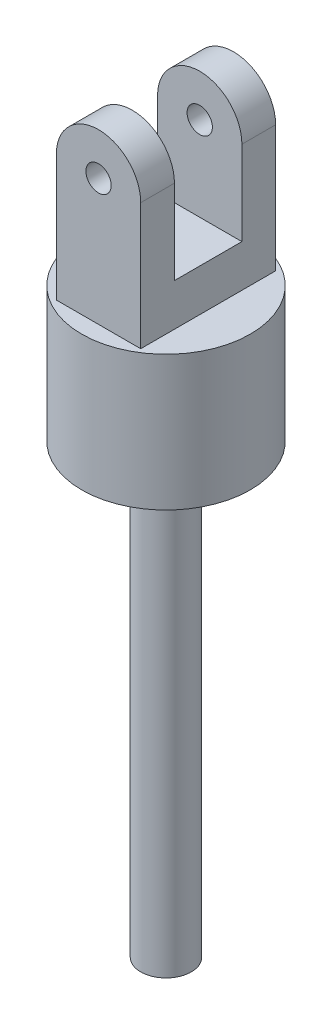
from build123d import *

# Parameters (mm, degrees)
SKETCH_1_W          = 10
SKETCH_1_H          = 4
EXTRUDE_1_DEPTH     = 15
EXTRUDE_1_2_DEPTH   = 15
SKETCH_1_4_W        = 10
SKETCH_1_4_H        = 8
SKETCH_1_4_H_2      = 4
EXTRUDE_2_DEPTH     = 4
CUT_EXTRUDE_3_REACH = 28.944
SKETCH_2_R          = 1.5
SKETCH_3_R          = 3
EXTRUDE_3_DEPTH     = 70
SKETCH_4_W          = 10
SKETCH_4_H          = 16
EXTRUDE_4_DEPTH     = 1
SKETCH_5_R          = 3
EXTRUDE_5_DEPTH     = 4
SKETCH_5_3_R        = 10
EXTRUDE_6_DEPTH     = 16


with BuildPart() as part:
    # Sketch 1 → Extrude 1 (new body)
    with BuildSketch(Plane(origin=(0, 0, 0), x_dir=(1, 0, 0), z_dir=(0, 1, 0))):
        with Locations((-10.652173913, 4.260869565)):
            Rectangle(SKETCH_1_W, SKETCH_1_H)
    extrude(amount=EXTRUDE_1_DEPTH)



with BuildPart() as body_2:
    # Sketch 1 → Extrude 1 2 (new body)
    with BuildSketch(Plane(origin=(0, 0, 0), x_dir=(1, 0, 0), z_dir=(0, 1, 0))):
        with Locations((-10.652173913, -7.739130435)):
            Rectangle(SKETCH_1_W, SKETCH_1_H)
    extrude(amount=EXTRUDE_1_2_DEPTH)


with BuildPart() as part_1:
    add(part.part)

    add(body_2.part)  # Extrude 2 merges body 2
    # Sketch 1_4 → Extrude 2 (add)
    with BuildSketch(Plane(origin=(0, 0, 0), x_dir=(1, 0, 0), z_dir=(0, 1, 0))):
        with Locations((-10.652173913, -1.739130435)):
            Rectangle(SKETCH_1_4_W, SKETCH_1_4_H)
        with Locations((-10.652173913, -7.739130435)):
            Rectangle(SKETCH_1_4_W, SKETCH_1_4_H_2)
        with Locations((-10.652173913, 4.260869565)):
            Rectangle(SKETCH_1_4_W, SKETCH_1_4_H_2)
    extrude(amount=-EXTRUDE_2_DEPTH)

    # Cut-Extrude 3: up to this face of the body (flat: up to its plane)
    cut_extrude_3_end = Plane(part_1.part.faces().sort_by_distance((-10.652173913, 5.5, -6.260869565))[0])
    # Sketch 2 → Cut-Extrude 3 (cut, up to the picked face)
    with BuildSketch(Plane.XY.offset(9.739130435), mode=Mode.PRIVATE) as cut_extrude_3_sk1:
        with Locations((-10.652173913, 10)):
            Circle(SKETCH_2_R)
    cut_extrude_3_tool1 = split(extrude(cut_extrude_3_sk1.sketch, amount=-CUT_EXTRUDE_3_REACH, mode=Mode.PRIVATE), bisect_by=cut_extrude_3_end, keep=Keep.BOTH, mode=Mode.PRIVATE)
    # Sketch 2 → Cut-Extrude 3 (cut, up to the picked face)
    with BuildSketch(Plane.XY.offset(9.739130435), mode=Mode.PRIVATE) as cut_extrude_3_sk2:
        with BuildLine():
            Line((-15.652173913, 15), (-15.652173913, 10))
            ThreePointArc((-15.652173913, 10), (-14.187707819, 13.535533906), (-10.652173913, 15))
            Line((-10.652173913, 15), (-15.652173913, 15))
        make_face()
    cut_extrude_3_tool2 = split(extrude(cut_extrude_3_sk2.sketch, amount=-CUT_EXTRUDE_3_REACH, mode=Mode.PRIVATE), bisect_by=cut_extrude_3_end, keep=Keep.BOTH, mode=Mode.PRIVATE)
    # Sketch 2 → Cut-Extrude 3 (cut, up to the picked face)
    with BuildSketch(Plane.XY.offset(9.739130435), mode=Mode.PRIVATE) as cut_extrude_3_sk3:
        with BuildLine():
            ThreePointArc((-10.652173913, 15), (-7.116640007, 13.535533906), (-5.652173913, 10))
            Line((-5.652173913, 10), (-5.652173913, 15))
            Line((-5.652173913, 15), (-10.652173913, 15))
        make_face()
    cut_extrude_3_tool3 = split(extrude(cut_extrude_3_sk3.sketch, amount=-CUT_EXTRUDE_3_REACH, mode=Mode.PRIVATE), bisect_by=cut_extrude_3_end, keep=Keep.BOTH, mode=Mode.PRIVATE)
    add(cut_extrude_3_tool1.solids().sort_by(Axis((-10.652174, 10, 9.73913), (0, 0, -1)))[0], mode=Mode.SUBTRACT)
    add(cut_extrude_3_tool2.solids().sort_by(Axis((-14.535334, 13.88316, 9.73913), (0, 0, -1)))[0], mode=Mode.SUBTRACT)
    add(cut_extrude_3_tool3.solids().sort_by(Axis((-6.769014, 13.88316, 9.73913), (0, 0, -1)))[0], mode=Mode.SUBTRACT)

    # Sketch 3 → Extrude 3 (add)
    with BuildSketch(Plane.XZ.offset(4)):
        with Locations(Location((-10.652173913, 1.739130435, 0), (0, 0, 270))):
            Circle(SKETCH_3_R)
    extrude(amount=EXTRUDE_3_DEPTH)

    # Sketch 4 → Extrude 4 (add)
    with BuildSketch(Plane.XZ.offset(4)):
        with Locations((-10.652173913, 1.739130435)):
            Rectangle(SKETCH_4_W, SKETCH_4_H)
    extrude(amount=EXTRUDE_4_DEPTH)

    # Sketch 5 → Extrude 5 (add)
    # profile 1 of 3: a face of its own
    with BuildSketch(Plane.XZ.offset(5)):
        with BuildLine():
            Line((-15.652173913, -4.505867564), (-15.652173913, 7.984128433))
            ThreePointArc((-15.652173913, 7.984128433), (-18.652173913, 1.739130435), (-15.652173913, -4.505867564))
        make_face()
    # profile 2 of 3: a face of its own
    with BuildSketch(Plane.XZ.offset(5)):
        with BuildLine():
            ThreePointArc((-5.652173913, 7.984128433), (-8.002644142, 9.287639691), (-10.652173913, 9.739130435))
            ThreePointArc((-10.652173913, 9.739130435), (-13.301703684, 9.287639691), (-15.652173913, 7.984128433))
            Line((-15.652173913, 7.984128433), (-15.652173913, -4.505867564))
            ThreePointArc((-15.652173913, -4.505867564), (-13.301703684, -5.809378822), (-10.652173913, -6.260869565))
            ThreePointArc((-10.652173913, -6.260869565), (-8.002644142, -5.809378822), (-5.652173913, -4.505867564))
            Line((-5.652173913, -4.505867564), (-5.652173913, 7.984128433))
        make_face()
        with Locations(Location((-10.652173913, 1.739130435, 0), (0, 0, 270))):
            Circle(SKETCH_5_R, mode=Mode.SUBTRACT)
    # profile 3 of 3: a face of its own
    with BuildSketch(Plane.XZ.offset(5)):
        with BuildLine():
            ThreePointArc((-2.652173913, 1.739130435), (-3.441071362, 5.20323205), (-5.652173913, 7.984128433))
            Line((-5.652173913, 7.984128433), (-5.652173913, -4.505867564))
            ThreePointArc((-5.652173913, -4.505867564), (-3.441071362, -1.72497118), (-2.652173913, 1.739130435))
        make_face()
    extrude(amount=EXTRUDE_5_DEPTH)

    # Sketch 5_3 → Extrude 6 (add)
    # profile 1 of 5: a face of its own
    with BuildSketch(Plane.XZ.offset(5)):
        with Locations(Location((-10.652173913, 1.739130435, 0), (0, 0, 270))):
            Circle(SKETCH_5_3_R)
        with BuildLine():
            Line((-10.652173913, 9.739130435), (-5.652173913, 9.739130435))
            Line((-5.652173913, 9.739130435), (-5.652173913, 7.984128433))
            ThreePointArc((-5.652173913, 7.984128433), (-3.441071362, 5.20323205), (-2.652173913, 1.739130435))
            ThreePointArc((-2.652173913, 1.739130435), (-3.441071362, -1.72497118), (-5.652173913, -4.505867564))
            Line((-5.652173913, -4.505867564), (-5.652173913, -6.260869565))
            Line((-5.652173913, -6.260869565), (-10.652173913, -6.260869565))
            Line((-10.652173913, -6.260869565), (-15.652173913, -6.260869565))
            Line((-15.652173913, -6.260869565), (-15.652173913, -4.505867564))
            ThreePointArc((-15.652173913, -4.505867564), (-18.652173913, 1.739130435), (-15.652173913, 7.984128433))
            Line((-15.652173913, 7.984128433), (-15.652173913, 9.739130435))
            Line((-15.652173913, 9.739130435), (-10.652173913, 9.739130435))
        make_face(mode=Mode.SUBTRACT)
    # profile 2 of 5: a face of its own
    with BuildSketch(Plane.XZ.offset(5)):
        with BuildLine():
            ThreePointArc((-15.652173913, 7.984128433), (-13.301703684, 9.287639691), (-10.652173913, 9.739130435))
            Line((-10.652173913, 9.739130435), (-15.652173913, 9.739130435))
            Line((-15.652173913, 9.739130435), (-15.652173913, 7.984128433))
        make_face()
    # profile 3 of 5: a face of its own
    with BuildSketch(Plane.XZ.offset(5)):
        with BuildLine():
            Line((-5.652173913, 7.984128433), (-5.652173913, 9.739130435))
            Line((-5.652173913, 9.739130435), (-10.652173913, 9.739130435))
            ThreePointArc((-10.652173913, 9.739130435), (-8.002644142, 9.287639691), (-5.652173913, 7.984128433))
        make_face()
    # profile 4 of 5: a face of its own
    with BuildSketch(Plane.XZ.offset(5)):
        with BuildLine():
            ThreePointArc((-10.652173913, -6.260869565), (-13.301703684, -5.809378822), (-15.652173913, -4.505867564))
            Line((-15.652173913, -4.505867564), (-15.652173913, -6.260869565))
            Line((-15.652173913, -6.260869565), (-10.652173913, -6.260869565))
        make_face()
    # profile 5 of 5: a face of its own
    with BuildSketch(Plane.XZ.offset(5)):
        with BuildLine():
            Line((-5.652173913, -6.260869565), (-5.652173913, -4.505867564))
            ThreePointArc((-5.652173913, -4.505867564), (-8.002644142, -5.809378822), (-10.652173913, -6.260869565))
            Line((-10.652173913, -6.260869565), (-5.652173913, -6.260869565))
        make_face()
    extrude(amount=EXTRUDE_6_DEPTH)


solid = part_1.part
